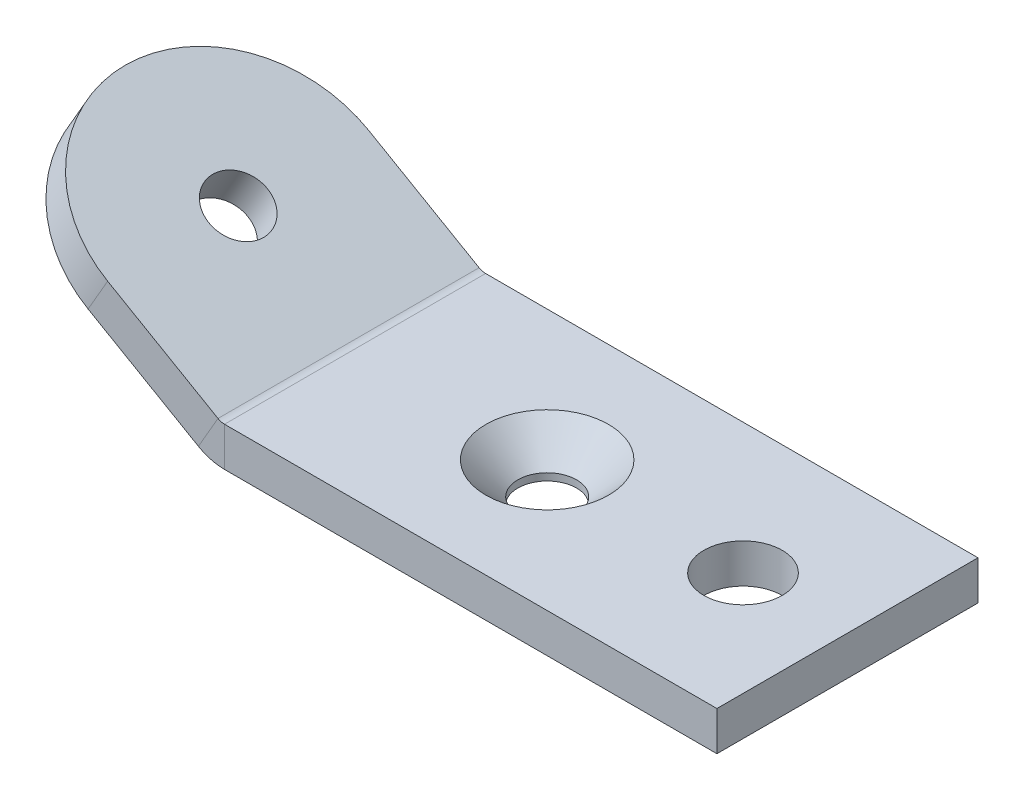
ISO-10303-21;
HEADER;
FILE_DESCRIPTION(('STEP AP214'),'2;1');
FILE_NAME('part.step','',(''),(''),'','','');
FILE_SCHEMA(('AUTOMOTIVE_DESIGN { 1 0 10303 214 1 1 1 1 }'));
ENDSEC;
DATA;
#1=APPLICATION_CONTEXT('core data for automotive mechanical design processes');
#2=APPLICATION_PROTOCOL_DEFINITION('international standard','automotive_design',2000,#1);
#3=PRODUCT_CONTEXT('',#1,'mechanical');
#4=PRODUCT('Part','Part','',(#3));
#5=PRODUCT_RELATED_PRODUCT_CATEGORY('part','',(#4));
#6=PRODUCT_DEFINITION_FORMATION('','',#4);
#7=PRODUCT_DEFINITION_CONTEXT('part definition',#1,'design');
#8=PRODUCT_DEFINITION('design','',#6,#7);
#9=PRODUCT_DEFINITION_SHAPE('','',#8);
#10=(LENGTH_UNIT() NAMED_UNIT(*) SI_UNIT(.MILLI.,.METRE.));
#11=(NAMED_UNIT(*) PLANE_ANGLE_UNIT() SI_UNIT($,.RADIAN.));
#12=(NAMED_UNIT(*) SI_UNIT($,.STERADIAN.) SOLID_ANGLE_UNIT());
#13=UNCERTAINTY_MEASURE_WITH_UNIT(LENGTH_MEASURE(1.E-05),#10,'distance_accuracy_value','');
#14=(GEOMETRIC_REPRESENTATION_CONTEXT(3) GLOBAL_UNCERTAINTY_ASSIGNED_CONTEXT((#13)) GLOBAL_UNIT_ASSIGNED_CONTEXT((#10,
#11,#12)) REPRESENTATION_CONTEXT('',''));
#15=CARTESIAN_POINT('',(0.,0.,0.));
#16=DIRECTION('',(0.,0.,1.));
#17=DIRECTION('',(1.,0.,0.));
#18=AXIS2_PLACEMENT_3D('',#15,#16,#17);
#19=CARTESIAN_POINT('',(-46.6689491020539,8.01339372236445,-10.));
#20=DIRECTION('',(0.500000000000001,0.866025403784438,0.));
#21=DIRECTION('',(0.,0.,1.));
#22=AXIS2_PLACEMENT_3D('',#19,#20,#21);
#23=PLANE('',#22);
#24=CARTESIAN_POINT('',(-46.6689491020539,8.01339372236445,-10.));
#25=DIRECTION('',(0.500000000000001,0.866025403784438,0.));
#26=DIRECTION('',(0.,0.,1.));
#27=AXIS2_PLACEMENT_3D('',#24,#25,#26);
#28=CIRCLE('',#27,2.25);
#29=CARTESIAN_POINT('',(-46.6689491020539,8.01339372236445,-7.75000000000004));
#30=VERTEX_POINT('',#29);
#31=EDGE_CURVE('E98',#30,#30,#28,.T.);
#32=ORIENTED_EDGE('',*,*,#31,.F.);
#33=EDGE_LOOP('',(#32));
#34=FACE_BOUND('',#33,.T.);
#35=DIRECTION('',(0.866025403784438,-0.500000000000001,0.));
#36=VECTOR('',#35,1.);
#37=CARTESIAN_POINT('',(-5.09972972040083,-15.9866062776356,0.));
#38=LINE('',#37,#36);
#39=CARTESIAN_POINT('',(-46.6689491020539,8.01339372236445,0.));
#40=VERTEX_POINT('',#39);
#41=CARTESIAN_POINT('',(-38.2175472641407,3.13397459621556,0.));
#42=VERTEX_POINT('',#41);
#43=EDGE_CURVE('E41',#40,#42,#38,.T.);
#44=ORIENTED_EDGE('',*,*,#43,.T.);
#45=DIRECTION('',(0.,0.,-1.));
#46=VECTOR('',#45,1.);
#47=CARTESIAN_POINT('',(-38.2175472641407,3.13397459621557,-10.));
#48=LINE('',#47,#46);
#49=CARTESIAN_POINT('',(-38.2175472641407,3.13397459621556,-20.));
#50=VERTEX_POINT('',#49);
#51=EDGE_CURVE('E109',#42,#50,#48,.T.);
#52=ORIENTED_EDGE('',*,*,#51,.T.);
#53=DIRECTION('',(-0.866025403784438,0.500000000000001,0.));
#54=VECTOR('',#53,1.);
#55=CARTESIAN_POINT('',(-5.09972972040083,-15.9866062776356,-20.));
#56=LINE('',#55,#54);
#57=CARTESIAN_POINT('',(-46.6689491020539,8.01339372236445,-20.));
#58=VERTEX_POINT('',#57);
#59=EDGE_CURVE('E104',#50,#58,#56,.T.);
#60=ORIENTED_EDGE('',*,*,#59,.T.);
#61=CARTESIAN_POINT('',(-46.6689491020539,8.01339372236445,-10.));
#62=DIRECTION('',(0.500000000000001,0.866025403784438,0.));
#63=DIRECTION('',(0.,0.,1.));
#64=AXIS2_PLACEMENT_3D('',#61,#62,#63);
#65=CIRCLE('',#64,10.);
#66=EDGE_CURVE('E62',#58,#40,#65,.T.);
#67=ORIENTED_EDGE('',*,*,#66,.T.);
#68=EDGE_LOOP('',(#44,#52,#60,#67));
#69=FACE_BOUND('',#68,.T.);
#70=ADVANCED_FACE('F37',(#34,#69),#23,.T.);
#71=CARTESIAN_POINT('',(-48.1689491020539,5.41531751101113,-10.));
#72=DIRECTION('',(0.500000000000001,0.866025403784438,0.));
#73=DIRECTION('',(0.,0.,1.));
#74=AXIS2_PLACEMENT_3D('',#71,#72,#73);
#75=PLANE('',#74);
#76=DIRECTION('',(0.,0.,-1.));
#77=VECTOR('',#76,1.);
#78=CARTESIAN_POINT('',(-39.7175472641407,0.535898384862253,-10.));
#79=LINE('',#78,#77);
#80=CARTESIAN_POINT('',(-39.7175472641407,0.535898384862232,0.));
#81=VERTEX_POINT('',#80);
#82=CARTESIAN_POINT('',(-39.7175472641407,0.535898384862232,-20.));
#83=VERTEX_POINT('',#82);
#84=EDGE_CURVE('E46',#81,#83,#79,.T.);
#85=ORIENTED_EDGE('',*,*,#84,.F.);
#86=DIRECTION('',(0.866025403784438,-0.500000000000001,0.));
#87=VECTOR('',#86,1.);
#88=CARTESIAN_POINT('',(-6.59972972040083,-18.5846824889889,0.));
#89=LINE('',#88,#87);
#90=CARTESIAN_POINT('',(-48.1689491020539,5.41531751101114,0.));
#91=VERTEX_POINT('',#90);
#92=EDGE_CURVE('E92',#91,#81,#89,.T.);
#93=ORIENTED_EDGE('',*,*,#92,.F.);
#94=CARTESIAN_POINT('',(-48.1689491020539,5.41531751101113,-10.));
#95=DIRECTION('',(0.500000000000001,0.866025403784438,0.));
#96=DIRECTION('',(0.,0.,1.));
#97=AXIS2_PLACEMENT_3D('',#94,#95,#96);
#98=CIRCLE('',#97,10.);
#99=CARTESIAN_POINT('',(-48.1689491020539,5.41531751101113,-20.));
#100=VERTEX_POINT('',#99);
#101=EDGE_CURVE('E75',#100,#91,#98,.T.);
#102=ORIENTED_EDGE('',*,*,#101,.F.);
#103=DIRECTION('',(-0.866025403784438,0.500000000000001,0.));
#104=VECTOR('',#103,1.);
#105=CARTESIAN_POINT('',(-6.59972972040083,-18.5846824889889,-20.));
#106=LINE('',#105,#104);
#107=EDGE_CURVE('E85',#83,#100,#106,.T.);
#108=ORIENTED_EDGE('',*,*,#107,.F.);
#109=EDGE_LOOP('',(#85,#93,#102,#108));
#110=FACE_BOUND('',#109,.T.);
#111=CARTESIAN_POINT('',(-48.1689491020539,5.41531751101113,-10.));
#112=DIRECTION('',(0.500000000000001,0.866025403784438,0.));
#113=DIRECTION('',(0.,0.,1.));
#114=AXIS2_PLACEMENT_3D('',#111,#112,#113);
#115=CIRCLE('',#114,2.25);
#116=CARTESIAN_POINT('',(-48.1689491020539,5.41531751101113,-7.75000000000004));
#117=VERTEX_POINT('',#116);
#118=EDGE_CURVE('E102',#117,#117,#115,.T.);
#119=ORIENTED_EDGE('',*,*,#118,.T.);
#120=EDGE_LOOP('',(#119));
#121=FACE_BOUND('',#120,.T.);
#122=ADVANCED_FACE('F95',(#110,#121),#75,.F.);
#123=CARTESIAN_POINT('',(-5.09972972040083,-15.9866062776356,0.));
#124=DIRECTION('',(0.,0.,-1.));
#125=DIRECTION('',(-0.866025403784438,0.500000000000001,0.));
#126=AXIS2_PLACEMENT_3D('',#123,#124,#125);
#127=PLANE('',#126);
#128=DIRECTION('',(-0.500000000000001,-0.866025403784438,0.));
#129=VECTOR('',#128,1.);
#130=CARTESIAN_POINT('',(-38.2175472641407,3.13397459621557,0.));
#131=LINE('',#130,#129);
#132=EDGE_CURVE('E114',#42,#81,#131,.T.);
#133=ORIENTED_EDGE('',*,*,#132,.F.);
#134=ORIENTED_EDGE('',*,*,#43,.F.);
#135=DIRECTION('',(-0.500000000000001,-0.866025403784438,0.));
#136=VECTOR('',#135,1.);
#137=CARTESIAN_POINT('',(-46.6689491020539,8.01339372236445,0.));
#138=LINE('',#137,#136);
#139=EDGE_CURVE('E78',#40,#91,#138,.T.);
#140=ORIENTED_EDGE('',*,*,#139,.T.);
#141=ORIENTED_EDGE('',*,*,#92,.T.);
#142=EDGE_LOOP('',(#133,#134,#140,#141));
#143=FACE_BOUND('',#142,.T.);
#144=ADVANCED_FACE('F90',(#143),#127,.F.);
#145=CARTESIAN_POINT('',(-5.09972972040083,-15.9866062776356,-20.));
#146=DIRECTION('',(0.,0.,1.));
#147=DIRECTION('',(0.866025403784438,-0.500000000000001,0.));
#148=AXIS2_PLACEMENT_3D('',#145,#146,#147);
#149=PLANE('',#148);
#150=DIRECTION('',(0.500000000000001,0.866025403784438,0.));
#151=VECTOR('',#150,1.);
#152=CARTESIAN_POINT('',(-38.2175472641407,3.13397459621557,-20.));
#153=LINE('',#152,#151);
#154=EDGE_CURVE('E12',#83,#50,#153,.T.);
#155=ORIENTED_EDGE('',*,*,#154,.F.);
#156=ORIENTED_EDGE('',*,*,#107,.T.);
#157=DIRECTION('',(-0.500000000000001,-0.866025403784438,0.));
#158=VECTOR('',#157,1.);
#159=CARTESIAN_POINT('',(-46.6689491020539,8.01339372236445,-20.));
#160=LINE('',#159,#158);
#161=EDGE_CURVE('E81',#58,#100,#160,.T.);
#162=ORIENTED_EDGE('',*,*,#161,.F.);
#163=ORIENTED_EDGE('',*,*,#59,.F.);
#164=EDGE_LOOP('',(#155,#156,#162,#163));
#165=FACE_BOUND('',#164,.T.);
#166=ADVANCED_FACE('F39',(#165),#149,.F.);
#167=CARTESIAN_POINT('',(-46.6689491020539,8.01339372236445,-10.));
#168=DIRECTION('',(-0.500000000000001,-0.866025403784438,0.));
#169=DIRECTION('',(0.,0.,-1.));
#170=AXIS2_PLACEMENT_3D('',#167,#168,#169);
#171=CYLINDRICAL_SURFACE('',#170,10.);
#172=ORIENTED_EDGE('',*,*,#101,.T.);
#173=ORIENTED_EDGE('',*,*,#139,.F.);
#174=ORIENTED_EDGE('',*,*,#66,.F.);
#175=ORIENTED_EDGE('',*,*,#161,.T.);
#176=EDGE_LOOP('',(#172,#173,#174,#175));
#177=FACE_BOUND('',#176,.T.);
#178=ADVANCED_FACE('F77',(#177),#171,.T.);
#179=CARTESIAN_POINT('',(-46.6689491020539,8.01339372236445,-10.));
#180=DIRECTION('',(-0.500000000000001,-0.866025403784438,0.));
#181=DIRECTION('',(0.,0.,-1.));
#182=AXIS2_PLACEMENT_3D('',#179,#180,#181);
#183=CYLINDRICAL_SURFACE('',#182,2.25);
#184=ORIENTED_EDGE('',*,*,#31,.T.);
#185=EDGE_LOOP('',(#184));
#186=FACE_BOUND('',#185,.T.);
#187=ORIENTED_EDGE('',*,*,#118,.F.);
#188=EDGE_LOOP('',(#187));
#189=FACE_BOUND('',#188,.T.);
#190=ADVANCED_FACE('F230',(#186,#189),#183,.F.);
#191=CARTESIAN_POINT('',(-23.,3.,-10.));
#192=DIRECTION('',(0.,1.,0.));
#193=DIRECTION('',(0.,0.,1.));
#194=AXIS2_PLACEMENT_3D('',#191,#192,#193);
#195=CYLINDRICAL_SURFACE('',#194,2.25);
#196=CARTESIAN_POINT('',(-23.,0.,-10.));
#197=DIRECTION('',(0.,1.,0.));
#198=DIRECTION('',(0.,0.,1.));
#199=AXIS2_PLACEMENT_3D('',#196,#197,#198);
#200=CIRCLE('',#199,2.25);
#201=CARTESIAN_POINT('',(-23.,0.,-7.75000000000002));
#202=VERTEX_POINT('',#201);
#203=EDGE_CURVE('E162',#202,#202,#200,.T.);
#204=ORIENTED_EDGE('',*,*,#203,.F.);
#205=EDGE_LOOP('',(#204));
#206=FACE_BOUND('',#205,.T.);
#207=CARTESIAN_POINT('',(-23.,0.550000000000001,-10.));
#208=DIRECTION('',(0.,1.,0.));
#209=DIRECTION('',(0.,0.,1.));
#210=AXIS2_PLACEMENT_3D('',#207,#208,#209);
#211=CIRCLE('',#210,2.25);
#212=CARTESIAN_POINT('',(-23.,0.550000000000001,-7.75000000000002));
#213=VERTEX_POINT('',#212);
#214=EDGE_CURVE('E129',#213,#213,#211,.T.);
#215=ORIENTED_EDGE('',*,*,#214,.T.);
#216=EDGE_LOOP('',(#215));
#217=FACE_BOUND('',#216,.T.);
#218=ADVANCED_FACE('F243',(#206,#217),#195,.F.);
#219=CARTESIAN_POINT('',(-8.,3.,-10.));
#220=DIRECTION('',(0.,-1.,0.));
#221=DIRECTION('',(0.,0.,-1.));
#222=AXIS2_PLACEMENT_3D('',#219,#220,#221);
#223=CYLINDRICAL_SURFACE('',#222,3.);
#224=CARTESIAN_POINT('',(-8.,3.,-10.));
#225=DIRECTION('',(0.,1.,0.));
#226=DIRECTION('',(0.,0.,1.));
#227=AXIS2_PLACEMENT_3D('',#224,#225,#226);
#228=CIRCLE('',#227,3.);
#229=CARTESIAN_POINT('',(-8.,3.,-7.00000000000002));
#230=VERTEX_POINT('',#229);
#231=EDGE_CURVE('E132',#230,#230,#228,.T.);
#232=ORIENTED_EDGE('',*,*,#231,.T.);
#233=EDGE_LOOP('',(#232));
#234=FACE_BOUND('',#233,.T.);
#235=CARTESIAN_POINT('',(-8.,0.,-10.));
#236=DIRECTION('',(0.,1.,0.));
#237=DIRECTION('',(0.,0.,1.));
#238=AXIS2_PLACEMENT_3D('',#235,#236,#237);
#239=CIRCLE('',#238,3.);
#240=CARTESIAN_POINT('',(-8.,0.,-7.00000000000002));
#241=VERTEX_POINT('',#240);
#242=EDGE_CURVE('E159',#241,#241,#239,.T.);
#243=ORIENTED_EDGE('',*,*,#242,.F.);
#244=EDGE_LOOP('',(#243));
#245=FACE_BOUND('',#244,.T.);
#246=ADVANCED_FACE('F263',(#234,#245),#223,.F.);
#247=CARTESIAN_POINT('',(-23.,3.,-10.));
#248=DIRECTION('',(0.,1.,0.));
#249=DIRECTION('',(0.,0.,1.));
#250=AXIS2_PLACEMENT_3D('',#247,#248,#249);
#251=CONICAL_SURFACE('',#250,4.7,0.785398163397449);
#252=ORIENTED_EDGE('',*,*,#214,.F.);
#253=EDGE_LOOP('',(#252));
#254=FACE_BOUND('',#253,.T.);
#255=CARTESIAN_POINT('',(-23.,3.,-10.));
#256=DIRECTION('',(0.,1.,0.));
#257=DIRECTION('',(0.,0.,1.));
#258=AXIS2_PLACEMENT_3D('',#255,#256,#257);
#259=CIRCLE('',#258,4.7);
#260=CARTESIAN_POINT('',(-23.,3.,-5.30000000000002));
#261=VERTEX_POINT('',#260);
#262=EDGE_CURVE('E135',#261,#261,#259,.T.);
#263=ORIENTED_EDGE('',*,*,#262,.T.);
#264=EDGE_LOOP('',(#263));
#265=FACE_BOUND('',#264,.T.);
#266=ADVANCED_FACE('F260',(#254,#265),#251,.F.);
#267=CARTESIAN_POINT('',(0.,3.,0.));
#268=DIRECTION('',(-1.,0.,0.));
#269=DIRECTION('',(0.,0.,1.));
#270=AXIS2_PLACEMENT_3D('',#267,#268,#269);
#271=PLANE('',#270);
#272=DIRECTION('',(0.,0.,-1.));
#273=VECTOR('',#272,1.);
#274=CARTESIAN_POINT('',(0.,0.,0.));
#275=LINE('',#274,#273);
#276=CARTESIAN_POINT('',(0.,0.,0.));
#277=VERTEX_POINT('',#276);
#278=CARTESIAN_POINT('',(0.,0.,-20.));
#279=VERTEX_POINT('',#278);
#280=EDGE_CURVE('E138',#277,#279,#275,.T.);
#281=ORIENTED_EDGE('',*,*,#280,.T.);
#282=DIRECTION('',(0.,-1.,0.));
#283=VECTOR('',#282,1.);
#284=CARTESIAN_POINT('',(0.,3.,-20.));
#285=LINE('',#284,#283);
#286=CARTESIAN_POINT('',(0.,3.,-20.));
#287=VERTEX_POINT('',#286);
#288=EDGE_CURVE('E125',#287,#279,#285,.T.);
#289=ORIENTED_EDGE('',*,*,#288,.F.);
#290=DIRECTION('',(0.,0.,-1.));
#291=VECTOR('',#290,1.);
#292=CARTESIAN_POINT('',(0.,3.,0.));
#293=LINE('',#292,#291);
#294=CARTESIAN_POINT('',(0.,3.,0.));
#295=VERTEX_POINT('',#294);
#296=EDGE_CURVE('E147',#295,#287,#293,.T.);
#297=ORIENTED_EDGE('',*,*,#296,.F.);
#298=DIRECTION('',(0.,-1.,0.));
#299=VECTOR('',#298,1.);
#300=CARTESIAN_POINT('',(0.,3.,0.));
#301=LINE('',#300,#299);
#302=EDGE_CURVE('E141',#295,#277,#301,.T.);
#303=ORIENTED_EDGE('',*,*,#302,.T.);
#304=EDGE_LOOP('',(#281,#289,#297,#303));
#305=FACE_BOUND('',#304,.T.);
#306=ADVANCED_FACE('F206',(#305),#271,.F.);
#307=CARTESIAN_POINT('',(-48.,3.,-10.));
#308=DIRECTION('',(0.,1.,0.));
#309=DIRECTION('',(0.,0.,1.));
#310=AXIS2_PLACEMENT_3D('',#307,#308,#309);
#311=PLANE('',#310);
#312=DIRECTION('',(0.,0.,-1.));
#313=VECTOR('',#312,1.);
#314=CARTESIAN_POINT('',(-37.7175472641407,3.,-10.));
#315=LINE('',#314,#313);
#316=CARTESIAN_POINT('',(-37.7175472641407,3.,0.));
#317=VERTEX_POINT('',#316);
#318=CARTESIAN_POINT('',(-37.7175472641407,3.,-20.));
#319=VERTEX_POINT('',#318);
#320=EDGE_CURVE('E127',#317,#319,#315,.T.);
#321=ORIENTED_EDGE('',*,*,#320,.F.);
#322=DIRECTION('',(1.,0.,0.));
#323=VECTOR('',#322,1.);
#324=CARTESIAN_POINT('',(0.,3.,0.));
#325=LINE('',#324,#323);
#326=EDGE_CURVE('E144',#317,#295,#325,.T.);
#327=ORIENTED_EDGE('',*,*,#326,.T.);
#328=ORIENTED_EDGE('',*,*,#296,.T.);
#329=DIRECTION('',(-1.,0.,0.));
#330=VECTOR('',#329,1.);
#331=CARTESIAN_POINT('',(0.,3.,-20.));
#332=LINE('',#331,#330);
#333=EDGE_CURVE('E150',#287,#319,#332,.T.);
#334=ORIENTED_EDGE('',*,*,#333,.T.);
#335=EDGE_LOOP('',(#321,#327,#328,#334));
#336=FACE_BOUND('',#335,.T.);
#337=ORIENTED_EDGE('',*,*,#262,.F.);
#338=EDGE_LOOP('',(#337));
#339=FACE_BOUND('',#338,.T.);
#340=ORIENTED_EDGE('',*,*,#231,.F.);
#341=EDGE_LOOP('',(#340));
#342=FACE_BOUND('',#341,.T.);
#343=ADVANCED_FACE('F191',(#336,#339,#342),#311,.T.);
#344=CARTESIAN_POINT('',(0.,3.,0.));
#345=DIRECTION('',(0.,0.,-1.));
#346=DIRECTION('',(-1.,0.,0.));
#347=AXIS2_PLACEMENT_3D('',#344,#345,#346);
#348=PLANE('',#347);
#349=ORIENTED_EDGE('',*,*,#326,.F.);
#350=DIRECTION('',(0.,-1.,0.));
#351=VECTOR('',#350,1.);
#352=CARTESIAN_POINT('',(-37.7175472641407,3.,0.));
#353=LINE('',#352,#351);
#354=CARTESIAN_POINT('',(-37.7175472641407,0.,0.));
#355=VERTEX_POINT('',#354);
#356=EDGE_CURVE('E153',#317,#355,#353,.T.);
#357=ORIENTED_EDGE('',*,*,#356,.T.);
#358=DIRECTION('',(1.,0.,0.));
#359=VECTOR('',#358,1.);
#360=CARTESIAN_POINT('',(0.,0.,0.));
#361=LINE('',#360,#359);
#362=EDGE_CURVE('E156',#355,#277,#361,.T.);
#363=ORIENTED_EDGE('',*,*,#362,.T.);
#364=ORIENTED_EDGE('',*,*,#302,.F.);
#365=EDGE_LOOP('',(#349,#357,#363,#364));
#366=FACE_BOUND('',#365,.T.);
#367=ADVANCED_FACE('F198',(#366),#348,.F.);
#368=CARTESIAN_POINT('',(-48.,0.,-10.));
#369=DIRECTION('',(0.,1.,0.));
#370=DIRECTION('',(0.,0.,1.));
#371=AXIS2_PLACEMENT_3D('',#368,#369,#370);
#372=PLANE('',#371);
#373=ORIENTED_EDGE('',*,*,#242,.T.);
#374=EDGE_LOOP('',(#373));
#375=FACE_BOUND('',#374,.T.);
#376=ORIENTED_EDGE('',*,*,#203,.T.);
#377=EDGE_LOOP('',(#376));
#378=FACE_BOUND('',#377,.T.);
#379=ORIENTED_EDGE('',*,*,#362,.F.);
#380=DIRECTION('',(0.,0.,-1.));
#381=VECTOR('',#380,1.);
#382=CARTESIAN_POINT('',(-37.7175472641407,0.,-10.));
#383=LINE('',#382,#381);
#384=CARTESIAN_POINT('',(-37.7175472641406,0.,-20.));
#385=VERTEX_POINT('',#384);
#386=EDGE_CURVE('E165',#355,#385,#383,.T.);
#387=ORIENTED_EDGE('',*,*,#386,.T.);
#388=DIRECTION('',(-1.,0.,0.));
#389=VECTOR('',#388,1.);
#390=CARTESIAN_POINT('',(0.,0.,-20.));
#391=LINE('',#390,#389);
#392=EDGE_CURVE('E168',#279,#385,#391,.T.);
#393=ORIENTED_EDGE('',*,*,#392,.F.);
#394=ORIENTED_EDGE('',*,*,#280,.F.);
#395=EDGE_LOOP('',(#379,#387,#393,#394));
#396=FACE_BOUND('',#395,.T.);
#397=ADVANCED_FACE('F249',(#375,#378,#396),#372,.F.);
#398=CARTESIAN_POINT('',(0.,3.,-20.));
#399=DIRECTION('',(0.,0.,1.));
#400=DIRECTION('',(1.,0.,0.));
#401=AXIS2_PLACEMENT_3D('',#398,#399,#400);
#402=PLANE('',#401);
#403=ORIENTED_EDGE('',*,*,#392,.T.);
#404=DIRECTION('',(0.,1.,0.));
#405=VECTOR('',#404,1.);
#406=CARTESIAN_POINT('',(-37.7175472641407,3.,-20.));
#407=LINE('',#406,#405);
#408=EDGE_CURVE('E171',#385,#319,#407,.T.);
#409=ORIENTED_EDGE('',*,*,#408,.T.);
#410=ORIENTED_EDGE('',*,*,#333,.F.);
#411=ORIENTED_EDGE('',*,*,#288,.T.);
#412=EDGE_LOOP('',(#403,#409,#410,#411));
#413=FACE_BOUND('',#412,.T.);
#414=ADVANCED_FACE('F245',(#413),#402,.F.);
#415=CARTESIAN_POINT('',(-37.7175472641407,4.,0.));
#416=DIRECTION('',(0.,0.,-1.));
#417=DIRECTION('',(-1.,0.,0.));
#418=AXIS2_PLACEMENT_3D('',#415,#416,#417);
#419=PLANE('',#418);
#420=ORIENTED_EDGE('',*,*,#132,.T.);
#421=CARTESIAN_POINT('',(-37.7175472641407,4.,0.));
#422=DIRECTION('',(0.,0.,1.));
#423=DIRECTION('',(1.,0.,0.));
#424=AXIS2_PLACEMENT_3D('',#421,#422,#423);
#425=CIRCLE('',#424,4.);
#426=EDGE_CURVE('E180',#81,#355,#425,.T.);
#427=ORIENTED_EDGE('',*,*,#426,.T.);
#428=ORIENTED_EDGE('',*,*,#356,.F.);
#429=CARTESIAN_POINT('',(-37.7175472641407,4.,0.));
#430=DIRECTION('',(0.,0.,1.));
#431=DIRECTION('',(1.,0.,0.));
#432=AXIS2_PLACEMENT_3D('',#429,#430,#431);
#433=CIRCLE('',#432,0.999999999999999);
#434=EDGE_CURVE('E179',#42,#317,#433,.T.);
#435=ORIENTED_EDGE('',*,*,#434,.F.);
#436=EDGE_LOOP('',(#420,#427,#428,#435));
#437=FACE_BOUND('',#436,.T.);
#438=ADVANCED_FACE('F248',(#437),#419,.F.);
#439=CARTESIAN_POINT('',(-37.7175472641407,4.,-20.));
#440=DIRECTION('',(0.,0.,1.));
#441=DIRECTION('',(1.,0.,0.));
#442=AXIS2_PLACEMENT_3D('',#439,#440,#441);
#443=PLANE('',#442);
#444=CARTESIAN_POINT('',(-37.7175472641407,4.,-20.));
#445=DIRECTION('',(0.,0.,1.));
#446=DIRECTION('',(1.,0.,0.));
#447=AXIS2_PLACEMENT_3D('',#444,#445,#446);
#448=CIRCLE('',#447,4.);
#449=EDGE_CURVE('E176',#385,#83,#448,.F.);
#450=ORIENTED_EDGE('',*,*,#449,.T.);
#451=ORIENTED_EDGE('',*,*,#154,.T.);
#452=CARTESIAN_POINT('',(-37.7175472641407,4.,-20.));
#453=DIRECTION('',(0.,0.,-1.));
#454=DIRECTION('',(-1.,0.,0.));
#455=AXIS2_PLACEMENT_3D('',#452,#453,#454);
#456=CIRCLE('',#455,0.999999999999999);
#457=EDGE_CURVE('E54',#319,#50,#456,.T.);
#458=ORIENTED_EDGE('',*,*,#457,.F.);
#459=ORIENTED_EDGE('',*,*,#408,.F.);
#460=EDGE_LOOP('',(#450,#451,#458,#459));
#461=FACE_BOUND('',#460,.T.);
#462=ADVANCED_FACE('F222',(#461),#443,.F.);
#463=CARTESIAN_POINT('',(-37.7175472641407,4.,-30.2305257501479));
#464=DIRECTION('',(0.,0.,1.));
#465=DIRECTION('',(1.,0.,0.));
#466=AXIS2_PLACEMENT_3D('',#463,#464,#465);
#467=CYLINDRICAL_SURFACE('',#466,1.);
#468=ORIENTED_EDGE('',*,*,#320,.T.);
#469=ORIENTED_EDGE('',*,*,#457,.T.);
#470=ORIENTED_EDGE('',*,*,#51,.F.);
#471=ORIENTED_EDGE('',*,*,#434,.T.);
#472=EDGE_LOOP('',(#468,#469,#470,#471));
#473=FACE_BOUND('',#472,.T.);
#474=ADVANCED_FACE('F185',(#473),#467,.F.);
#475=CARTESIAN_POINT('',(-37.7175472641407,4.,-30.2305257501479));
#476=DIRECTION('',(0.,0.,1.));
#477=DIRECTION('',(1.,0.,0.));
#478=AXIS2_PLACEMENT_3D('',#475,#476,#477);
#479=CYLINDRICAL_SURFACE('',#478,4.);
#480=ORIENTED_EDGE('',*,*,#386,.F.);
#481=ORIENTED_EDGE('',*,*,#426,.F.);
#482=ORIENTED_EDGE('',*,*,#84,.T.);
#483=ORIENTED_EDGE('',*,*,#449,.F.);
#484=EDGE_LOOP('',(#480,#481,#482,#483));
#485=FACE_BOUND('',#484,.T.);
#486=ADVANCED_FACE('F219',(#485),#479,.T.);
#487=CLOSED_SHELL('',(#70,#122,#144,#166,#178,#190,#218,#246,#266,#306,#343,#367,#397,#414,#438,
#462,#474,#486));
#488=MANIFOLD_SOLID_BREP('B2',#487);
#489=ADVANCED_BREP_SHAPE_REPRESENTATION('',(#18,#488),#14);
#490=SHAPE_DEFINITION_REPRESENTATION(#9,#489);
ENDSEC;
END-ISO-10303-21;
